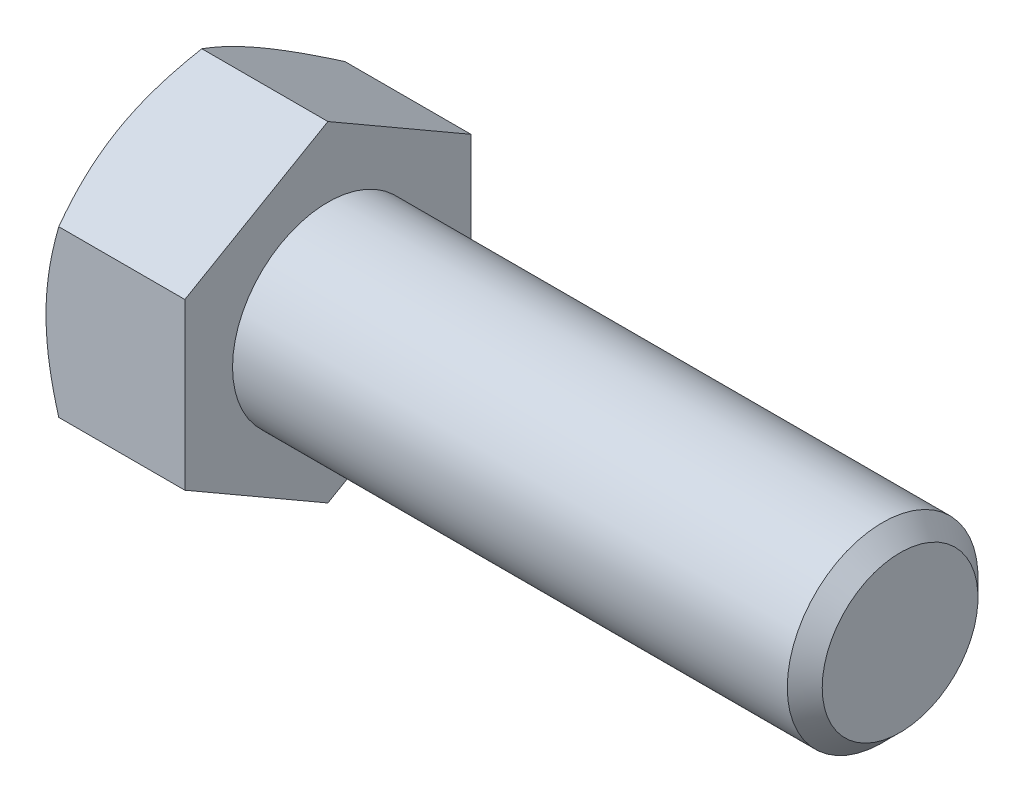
ISO-10303-21;
HEADER;
FILE_DESCRIPTION(('STEP AP214'),'2;1');
FILE_NAME('part.step','',(''),(''),'','','');
FILE_SCHEMA(('AUTOMOTIVE_DESIGN { 1 0 10303 214 1 1 1 1 }'));
ENDSEC;
DATA;
#1=APPLICATION_CONTEXT('core data for automotive mechanical design processes');
#2=APPLICATION_PROTOCOL_DEFINITION('international standard','automotive_design',2000,#1);
#3=PRODUCT_CONTEXT('',#1,'mechanical');
#4=PRODUCT('Part','Part','',(#3));
#5=PRODUCT_RELATED_PRODUCT_CATEGORY('part','',(#4));
#6=PRODUCT_DEFINITION_FORMATION('','',#4);
#7=PRODUCT_DEFINITION_CONTEXT('part definition',#1,'design');
#8=PRODUCT_DEFINITION('design','',#6,#7);
#9=PRODUCT_DEFINITION_SHAPE('','',#8);
#10=(LENGTH_UNIT() NAMED_UNIT(*) SI_UNIT(.MILLI.,.METRE.));
#11=(NAMED_UNIT(*) PLANE_ANGLE_UNIT() SI_UNIT($,.RADIAN.));
#12=(NAMED_UNIT(*) SI_UNIT($,.STERADIAN.) SOLID_ANGLE_UNIT());
#13=UNCERTAINTY_MEASURE_WITH_UNIT(LENGTH_MEASURE(1.E-05),#10,'distance_accuracy_value','');
#14=(GEOMETRIC_REPRESENTATION_CONTEXT(3) GLOBAL_UNCERTAINTY_ASSIGNED_CONTEXT((#13)) GLOBAL_UNIT_ASSIGNED_CONTEXT((#10,
#11,#12)) REPRESENTATION_CONTEXT('',''));
#15=CARTESIAN_POINT('',(0.,0.,0.));
#16=DIRECTION('',(0.,0.,1.));
#17=DIRECTION('',(1.,0.,0.));
#18=AXIS2_PLACEMENT_3D('',#15,#16,#17);
#19=CARTESIAN_POINT('',(9.2456,5.49926131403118,-9.525));
#20=DIRECTION('',(0.,-0.866025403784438,0.500000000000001));
#21=DIRECTION('',(0.,-0.500000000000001,-0.866025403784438));
#22=AXIS2_PLACEMENT_3D('',#19,#20,#21);
#23=PLANE('',#22);
#24=CARTESIAN_POINT('',(0.850805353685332,10.9986380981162,0.0002));
#25=CARTESIAN_POINT('',(0.781023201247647,10.8777523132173,-0.209180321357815));
#26=CARTESIAN_POINT('',(0.714408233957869,10.7564158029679,-0.419341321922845));
#27=CARTESIAN_POINT('',(0.58839146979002,10.5127697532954,-0.841348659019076));
#28=CARTESIAN_POINT('',(0.528992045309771,10.3904599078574,-1.05319552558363));
#29=CARTESIAN_POINT('',(0.362766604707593,10.0215595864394,-1.69214962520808));
#30=CARTESIAN_POINT('',(0.268218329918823,9.77351282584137,-2.12177921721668));
#31=CARTESIAN_POINT('',(0.157351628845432,9.40232220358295,-2.76470023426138));
#32=CARTESIAN_POINT('',(0.125769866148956,9.28028730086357,-2.97607088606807));
#33=CARTESIAN_POINT('',(0.0728092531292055,9.03565248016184,-3.39979082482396));
#34=CARTESIAN_POINT('',(0.0514305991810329,8.91305255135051,-3.61214013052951));
#35=CARTESIAN_POINT('',(0.0194239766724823,8.66764818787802,-4.03719295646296));
#36=CARTESIAN_POINT('',(0.00878323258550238,8.54484417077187,-4.24989575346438));
#37=CARTESIAN_POINT('',(-0.00152146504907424,8.29912270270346,-4.67549782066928));
#38=CARTESIAN_POINT('',(-0.00118575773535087,8.17620525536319,-4.88839708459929));
#39=CARTESIAN_POINT('',(0.0096988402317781,7.94640807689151,-5.28641747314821));
#40=CARTESIAN_POINT('',(0.0189199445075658,7.83951212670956,-5.47156668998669));
#41=CARTESIAN_POINT('',(0.0454848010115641,7.62597023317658,-5.84143209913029));
#42=CARTESIAN_POINT('',(0.0628291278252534,7.51932430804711,-6.02614825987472));
#43=CARTESIAN_POINT('',(0.126636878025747,7.19979976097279,-6.57958100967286));
#44=CARTESIAN_POINT('',(0.184867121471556,6.98748672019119,-6.94731798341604));
#45=CARTESIAN_POINT('',(0.330443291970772,6.56060850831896,-7.68669273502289));
#46=CARTESIAN_POINT('',(0.418406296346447,6.3460978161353,-8.05823615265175));
#47=CARTESIAN_POINT('',(0.618045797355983,5.92027529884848,-8.79578238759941));
#48=CARTESIAN_POINT('',(0.729675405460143,5.70895802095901,-9.16179464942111));
#49=CARTESIAN_POINT('',(0.850805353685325,5.49914584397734,-9.5252));
#50=B_SPLINE_CURVE_WITH_KNOTS('',3,(#24,#25,#26,#27,#28,#29,#30,#31,#32,#33,#34,#35,#36,#37,#38,
#39,#40,#41,#42,#43,#44,#45,#46,#47,#48,#49),.UNSPECIFIED.,.F.,.F.,(4,2,2,2,2,2,2,2,2,2,2,2,4),
(0.,0.754861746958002,1.50997101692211,3.02340406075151,3.76154608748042,4.49970232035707,
5.23697928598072,5.97423347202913,6.61604550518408,7.25790294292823,8.54252993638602,
9.85564695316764,11.1661863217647),.UNSPECIFIED.);
#51=CARTESIAN_POINT('',(0.850738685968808,10.9985226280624,0.));
#52=VERTEX_POINT('',#51);
#53=CARTESIAN_POINT('',(0.,8.24889197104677,-4.76250000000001));
#54=VERTEX_POINT('',#53);
#55=EDGE_CURVE('E46',#52,#54,#50,.T.);
#56=ORIENTED_EDGE('',*,*,#55,.F.);
#57=DIRECTION('',(-1.,0.,0.));
#58=VECTOR('',#57,1.);
#59=CARTESIAN_POINT('',(9.2456,10.9985226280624,0.));
#60=LINE('',#59,#58);
#61=CARTESIAN_POINT('',(9.2456,10.9985226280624,0.));
#62=VERTEX_POINT('',#61);
#63=EDGE_CURVE('E142',#62,#52,#60,.T.);
#64=ORIENTED_EDGE('',*,*,#63,.F.);
#65=DIRECTION('',(0.,0.500000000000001,0.866025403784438));
#66=VECTOR('',#65,1.);
#67=CARTESIAN_POINT('',(9.2456,5.49926131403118,-9.525));
#68=LINE('',#67,#66);
#69=CARTESIAN_POINT('',(9.2456,5.49926131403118,-9.525));
#70=VERTEX_POINT('',#69);
#71=EDGE_CURVE('E227',#70,#62,#68,.T.);
#72=ORIENTED_EDGE('',*,*,#71,.F.);
#73=DIRECTION('',(-1.,0.,0.));
#74=VECTOR('',#73,1.);
#75=CARTESIAN_POINT('',(9.2456,5.49926131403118,-9.525));
#76=LINE('',#75,#74);
#77=CARTESIAN_POINT('',(0.850738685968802,5.49926131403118,-9.525));
#78=VERTEX_POINT('',#77);
#79=EDGE_CURVE('E130',#70,#78,#76,.T.);
#80=ORIENTED_EDGE('',*,*,#79,.T.);
#81=EDGE_CURVE('E124',#54,#78,#50,.T.);
#82=ORIENTED_EDGE('',*,*,#81,.F.);
#83=EDGE_LOOP('',(#56,#64,#72,#80,#82));
#84=FACE_BOUND('',#83,.T.);
#85=ADVANCED_FACE('F30',(#84),#23,.F.);
#86=CARTESIAN_POINT('',(9.2456,10.9985226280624,0.));
#87=DIRECTION('',(0.,-0.866025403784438,-0.500000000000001));
#88=DIRECTION('',(0.,0.500000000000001,-0.866025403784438));
#89=AXIS2_PLACEMENT_3D('',#86,#87,#88);
#90=PLANE('',#89);
#91=CARTESIAN_POINT('',(0.850805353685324,5.49914584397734,9.5252));
#92=CARTESIAN_POINT('',(0.781023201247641,5.62003162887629,9.31581967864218));
#93=CARTESIAN_POINT('',(0.714408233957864,5.74136813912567,9.10565867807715));
#94=CARTESIAN_POINT('',(0.588391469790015,5.98501418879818,8.68365134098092));
#95=CARTESIAN_POINT('',(0.528992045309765,6.1073240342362,8.47180447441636));
#96=CARTESIAN_POINT('',(0.362766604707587,6.47622435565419,7.83285037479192));
#97=CARTESIAN_POINT('',(0.268218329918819,6.72427111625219,7.40322078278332));
#98=CARTESIAN_POINT('',(0.157351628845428,7.09546173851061,6.76029976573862));
#99=CARTESIAN_POINT('',(0.125769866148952,7.21749664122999,6.54892911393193));
#100=CARTESIAN_POINT('',(0.0728092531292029,7.46213146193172,6.12520917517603));
#101=CARTESIAN_POINT('',(0.0514305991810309,7.58473139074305,5.91285986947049));
#102=CARTESIAN_POINT('',(0.0194239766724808,7.83013575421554,5.48780704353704));
#103=CARTESIAN_POINT('',(0.00878323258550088,7.9529397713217,5.27510424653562));
#104=CARTESIAN_POINT('',(-0.00152146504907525,8.1986612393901,4.84950217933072));
#105=CARTESIAN_POINT('',(-0.00118575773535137,8.32157868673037,4.63660291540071));
#106=CARTESIAN_POINT('',(0.009698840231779,8.55137586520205,4.23858252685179));
#107=CARTESIAN_POINT('',(0.0189199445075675,8.658271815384,4.05343331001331));
#108=CARTESIAN_POINT('',(0.0454848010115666,8.87181370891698,3.68356790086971));
#109=CARTESIAN_POINT('',(0.0628291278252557,8.97845963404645,3.49885174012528));
#110=CARTESIAN_POINT('',(0.12663687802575,9.29798418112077,2.94541899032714));
#111=CARTESIAN_POINT('',(0.18486712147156,9.51029722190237,2.57768201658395));
#112=CARTESIAN_POINT('',(0.330443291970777,9.9371754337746,1.83830726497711));
#113=CARTESIAN_POINT('',(0.418406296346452,10.1516861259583,1.46676384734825));
#114=CARTESIAN_POINT('',(0.618045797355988,10.5775086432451,0.729217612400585));
#115=CARTESIAN_POINT('',(0.729675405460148,10.7888259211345,0.363205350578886));
#116=CARTESIAN_POINT('',(0.850805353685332,10.9986380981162,-0.000199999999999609));
#117=B_SPLINE_CURVE_WITH_KNOTS('',3,(#91,#92,#93,#94,#95,#96,#97,#98,#99,#100,#101,#102,#103,
#104,#105,#106,#107,#108,#109,#110,#111,#112,#113,#114,#115,#116),.UNSPECIFIED.,.F.,.F.,(4,2,2,
2,2,2,2,2,2,2,2,2,4),(0.,0.754861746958,1.50997101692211,3.0234040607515,3.76154608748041,
4.49970232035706,5.23697928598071,5.97423347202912,6.61604550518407,7.25790294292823,
8.54252993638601,9.85564695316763,11.1661863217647),.UNSPECIFIED.);
#118=CARTESIAN_POINT('',(0.850738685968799,5.49926131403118,9.525));
#119=VERTEX_POINT('',#118);
#120=CARTESIAN_POINT('',(0.,8.24889197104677,4.76250000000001));
#121=VERTEX_POINT('',#120);
#122=EDGE_CURVE('E53',#119,#121,#117,.T.);
#123=ORIENTED_EDGE('',*,*,#122,.F.);
#124=DIRECTION('',(-1.,0.,0.));
#125=VECTOR('',#124,1.);
#126=CARTESIAN_POINT('',(9.2456,5.49926131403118,9.525));
#127=LINE('',#126,#125);
#128=CARTESIAN_POINT('',(9.2456,5.49926131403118,9.525));
#129=VERTEX_POINT('',#128);
#130=EDGE_CURVE('E140',#129,#119,#127,.T.);
#131=ORIENTED_EDGE('',*,*,#130,.F.);
#132=DIRECTION('',(0.,-0.500000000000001,0.866025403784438));
#133=VECTOR('',#132,1.);
#134=CARTESIAN_POINT('',(9.2456,10.9985226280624,0.));
#135=LINE('',#134,#133);
#136=EDGE_CURVE('E225',#62,#129,#135,.T.);
#137=ORIENTED_EDGE('',*,*,#136,.F.);
#138=ORIENTED_EDGE('',*,*,#63,.T.);
#139=EDGE_CURVE('E157',#121,#52,#117,.T.);
#140=ORIENTED_EDGE('',*,*,#139,.F.);
#141=EDGE_LOOP('',(#123,#131,#137,#138,#140));
#142=FACE_BOUND('',#141,.T.);
#143=ADVANCED_FACE('F163',(#142),#90,.F.);
#144=CARTESIAN_POINT('',(9.2456,5.49926131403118,9.525));
#145=DIRECTION('',(0.,0.,-1.));
#146=DIRECTION('',(-1.,0.,0.));
#147=AXIS2_PLACEMENT_3D('',#144,#145,#146);
#148=PLANE('',#147);
#149=CARTESIAN_POINT('',(4.65297862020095,-14.7810115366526,9.525));
#150=CARTESIAN_POINT('',(4.55200114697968,-14.5729402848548,9.525));
#151=CARTESIAN_POINT('',(4.45152657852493,-14.3646250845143,9.525));
#152=CARTESIAN_POINT('',(4.25169715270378,-13.9474558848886,9.525));
#153=CARTESIAN_POINT('',(4.15234230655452,-13.7386018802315,9.525));
#154=CARTESIAN_POINT('',(3.85610205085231,-13.1110997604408,9.525));
#155=CARTESIAN_POINT('',(3.66107082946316,-12.6915729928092,9.525));
#156=CARTESIAN_POINT('',(3.2760831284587,-11.8474364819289,9.525));
#157=CARTESIAN_POINT('',(3.08615996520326,-11.422811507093,9.525));
#158=CARTESIAN_POINT('',(2.71407238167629,-10.5701875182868,9.525));
#159=CARTESIAN_POINT('',(2.53190759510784,-10.1421886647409,9.525));
#160=CARTESIAN_POINT('',(2.17173180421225,-9.2684082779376,9.525));
#161=CARTESIAN_POINT('',(1.99403865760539,-8.82249500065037,9.525));
#162=CARTESIAN_POINT('',(1.6520780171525,-7.92545654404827,9.525));
#163=CARTESIAN_POINT('',(1.48781202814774,-7.47433078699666,9.525));
#164=CARTESIAN_POINT('',(1.17701101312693,-6.56698486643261,9.525));
#165=CARTESIAN_POINT('',(1.03044020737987,-6.11077709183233,9.525));
#166=CARTESIAN_POINT('',(0.759723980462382,-5.19183461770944,9.525));
#167=CARTESIAN_POINT('',(0.635571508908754,-4.72910201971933,9.525));
#168=CARTESIAN_POINT('',(0.416296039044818,-3.79927533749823,9.525));
#169=CARTESIAN_POINT('',(0.321019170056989,-3.33221854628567,9.525));
#170=CARTESIAN_POINT('',(0.203895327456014,-2.62737339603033,9.525));
#171=CARTESIAN_POINT('',(0.169151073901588,-2.39169815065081,9.525));
#172=CARTESIAN_POINT('',(0.108940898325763,-1.91917305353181,9.525));
#173=CARTESIAN_POINT('',(0.0834740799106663,-1.68232331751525,9.525));
#174=CARTESIAN_POINT('',(0.042646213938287,-1.21086692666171,9.525));
#175=CARTESIAN_POINT('',(0.0271575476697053,-0.976271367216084,9.525));
#176=CARTESIAN_POINT('',(0.00611497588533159,-0.506635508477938,9.525));
#177=CARTESIAN_POINT('',(0.000560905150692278,-0.271595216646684,9.525));
#178=CARTESIAN_POINT('',(-0.000479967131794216,0.198511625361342,9.525));
#179=CARTESIAN_POINT('',(0.0040333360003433,0.433578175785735,9.525));
#180=CARTESIAN_POINT('',(0.0230169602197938,0.903311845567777,9.525));
#181=CARTESIAN_POINT('',(0.0374877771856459,1.1379789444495,9.525));
#182=CARTESIAN_POINT('',(0.0838926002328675,1.70156520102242,9.525));
#183=CARTESIAN_POINT('',(0.120529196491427,2.03010533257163,9.525));
#184=CARTESIAN_POINT('',(0.211324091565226,2.68473880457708,9.525));
#185=CARTESIAN_POINT('',(0.265484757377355,3.01083180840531,9.525));
#186=CARTESIAN_POINT('',(0.451380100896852,3.98506326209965,9.525));
#187=CARTESIAN_POINT('',(0.606495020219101,4.62879899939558,9.525));
#188=CARTESIAN_POINT('',(0.875429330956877,5.59158230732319,9.525));
#189=CARTESIAN_POINT('',(0.972405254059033,5.91562142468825,9.525));
#190=CARTESIAN_POINT('',(1.1764087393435,6.56055109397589,9.525));
#191=CARTESIAN_POINT('',(1.28343637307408,6.88144162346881,9.525));
#192=CARTESIAN_POINT('',(1.50582732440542,7.52017825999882,9.525));
#193=CARTESIAN_POINT('',(1.62118794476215,7.83802531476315,9.525));
#194=CARTESIAN_POINT('',(1.85888923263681,8.47108431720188,9.525));
#195=CARTESIAN_POINT('',(1.98122977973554,8.78629631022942,9.525));
#196=CARTESIAN_POINT('',(2.3006347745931,9.5871627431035,9.525));
#197=CARTESIAN_POINT('',(2.5017818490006,10.0711868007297,9.525));
#198=CARTESIAN_POINT('',(2.91473175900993,11.0346830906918,9.525));
#199=CARTESIAN_POINT('',(3.12653548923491,11.514154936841,9.525));
#200=CARTESIAN_POINT('',(3.55844219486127,12.469507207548,9.525));
#201=CARTESIAN_POINT('',(3.77854763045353,12.9453865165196,9.525));
#202=CARTESIAN_POINT('',(4.22520690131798,13.8940827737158,9.525));
#203=CARTESIAN_POINT('',(4.45176054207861,14.3668998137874,9.525));
#204=CARTESIAN_POINT('',(4.91030379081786,15.3106675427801,9.525));
#205=CARTESIAN_POINT('',(5.14230026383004,15.7816148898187,9.525));
#206=CARTESIAN_POINT('',(5.61043419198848,16.7214473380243,9.525));
#207=CARTESIAN_POINT('',(5.84657167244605,17.1903324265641,9.525));
#208=CARTESIAN_POINT('',(6.32217781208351,18.126306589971,9.525));
#209=CARTESIAN_POINT('',(6.56164589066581,18.5933959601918,9.525));
#210=CARTESIAN_POINT('',(7.04336394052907,19.5261387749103,9.525));
#211=CARTESIAN_POINT('',(7.28561392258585,19.9917922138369,9.525));
#212=CARTESIAN_POINT('',(7.96929589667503,21.298052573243,9.525));
#213=CARTESIAN_POINT('',(8.41334550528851,22.1372892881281,9.525));
#214=CARTESIAN_POINT('',(9.30698696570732,23.8128512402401,9.525));
#215=CARTESIAN_POINT('',(9.75657908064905,24.6491763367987,9.525));
#216=CARTESIAN_POINT('',(10.6586387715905,26.3171534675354,9.525));
#217=CARTESIAN_POINT('',(11.1110942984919,27.1488120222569,9.525));
#218=CARTESIAN_POINT('',(11.7921739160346,28.3949535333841,9.525));
#219=CARTESIAN_POINT('',(12.019592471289,28.8100962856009,9.525));
#220=CARTESIAN_POINT('',(12.4751463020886,29.6399876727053,9.525));
#221=CARTESIAN_POINT('',(12.703281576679,30.0547363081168,9.525));
#222=CARTESIAN_POINT('',(12.9317320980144,30.4693112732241,9.525));
#223=B_SPLINE_CURVE_WITH_KNOTS('',3,(#149,#150,#151,#152,#153,#154,#155,#156,#157,#158,#159,
#160,#161,#162,#163,#164,#165,#166,#167,#168,#169,#170,#171,#172,#173,#174,#175,#176,#177,#178,
#179,#180,#181,#182,#183,#184,#185,#186,#187,#188,#189,#190,#191,#192,#193,#194,#195,#196,#197,
#198,#199,#200,#201,#202,#203,#204,#205,#206,#207,#208,#209,#210,#211,#212,#213,#214,#215,#216,
#217,#218,#219,#220,#221,#222),.UNSPECIFIED.,.F.,.F.,(4,2,2,2,2,2,2,2,2,2,2,2,2,2,2,2,2,2,2,2,2,
2,2,2,2,2,2,2,2,2,2,2,2,2,2,2,4),(0.,0.693836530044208,1.38768000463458,2.77557197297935,
4.17100213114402,5.56636633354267,7.00624082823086,8.44627647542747,9.88334978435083,
11.3199703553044,12.748795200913,13.463308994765,14.1777537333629,14.882869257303,
15.5879730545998,16.2930841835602,16.9982304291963,17.9894005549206,18.9807046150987,
20.9643780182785,21.979010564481,22.9936503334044,24.0079631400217,25.022258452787,
26.5945433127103,28.1669603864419,29.7398471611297,31.3126865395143,32.8876294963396,
34.4625820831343,36.0372634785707,37.6119509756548,40.460336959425,43.3088586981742,
46.1491565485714,47.569213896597,48.9892693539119),.UNSPECIFIED.);
#224=CARTESIAN_POINT('',(0.850738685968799,-5.49926131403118,9.525));
#225=VERTEX_POINT('',#224);
#226=CARTESIAN_POINT('',(0.,0.,9.525));
#227=VERTEX_POINT('',#226);
#228=EDGE_CURVE('E237',#225,#227,#223,.T.);
#229=ORIENTED_EDGE('',*,*,#228,.F.);
#230=DIRECTION('',(-1.,0.,0.));
#231=VECTOR('',#230,1.);
#232=CARTESIAN_POINT('',(9.2456,-5.49926131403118,9.525));
#233=LINE('',#232,#231);
#234=CARTESIAN_POINT('',(9.2456,-5.49926131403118,9.525));
#235=VERTEX_POINT('',#234);
#236=EDGE_CURVE('E132',#235,#225,#233,.T.);
#237=ORIENTED_EDGE('',*,*,#236,.F.);
#238=DIRECTION('',(0.,-1.,0.));
#239=VECTOR('',#238,1.);
#240=CARTESIAN_POINT('',(9.2456,5.49926131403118,9.525));
#241=LINE('',#240,#239);
#242=EDGE_CURVE('E221',#129,#235,#241,.T.);
#243=ORIENTED_EDGE('',*,*,#242,.F.);
#244=ORIENTED_EDGE('',*,*,#130,.T.);
#245=EDGE_CURVE('E179',#227,#119,#223,.T.);
#246=ORIENTED_EDGE('',*,*,#245,.F.);
#247=EDGE_LOOP('',(#229,#237,#243,#244,#246));
#248=FACE_BOUND('',#247,.T.);
#249=ADVANCED_FACE('F243',(#248),#148,.F.);
#250=CARTESIAN_POINT('',(9.2456,-10.9985226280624,0.));
#251=DIRECTION('',(0.,0.866025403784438,-0.500000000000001));
#252=DIRECTION('',(0.,0.500000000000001,0.866025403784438));
#253=AXIS2_PLACEMENT_3D('',#250,#251,#252);
#254=PLANE('',#253);
#255=CARTESIAN_POINT('',(0.850805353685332,-10.9986380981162,-0.000199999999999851));
#256=CARTESIAN_POINT('',(0.781023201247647,-10.8777523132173,0.209180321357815));
#257=CARTESIAN_POINT('',(0.714408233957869,-10.7564158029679,0.419341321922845));
#258=CARTESIAN_POINT('',(0.58839146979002,-10.5127697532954,0.841348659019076));
#259=CARTESIAN_POINT('',(0.528992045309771,-10.3904599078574,1.05319552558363));
#260=CARTESIAN_POINT('',(0.362766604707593,-10.0215595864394,1.69214962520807));
#261=CARTESIAN_POINT('',(0.268218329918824,-9.77351282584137,2.12177921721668));
#262=CARTESIAN_POINT('',(0.157351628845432,-9.40232220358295,2.76470023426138));
#263=CARTESIAN_POINT('',(0.125769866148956,-9.28028730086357,2.97607088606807));
#264=CARTESIAN_POINT('',(0.0728092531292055,-9.03565248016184,3.39979082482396));
#265=CARTESIAN_POINT('',(0.0514305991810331,-8.91305255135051,3.61214013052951));
#266=CARTESIAN_POINT('',(0.0194239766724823,-8.66764818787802,4.03719295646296));
#267=CARTESIAN_POINT('',(0.00878323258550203,-8.54484417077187,4.24989575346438));
#268=CARTESIAN_POINT('',(-0.00152146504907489,-8.29912270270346,4.67549782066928));
#269=CARTESIAN_POINT('',(-0.00118575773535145,-8.17620525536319,4.88839708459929));
#270=CARTESIAN_POINT('',(0.00969884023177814,-7.94640807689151,5.28641747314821));
#271=CARTESIAN_POINT('',(0.0189199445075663,-7.83951212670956,5.47156668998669));
#272=CARTESIAN_POINT('',(0.0454848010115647,-7.62597023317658,5.84143209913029));
#273=CARTESIAN_POINT('',(0.0628291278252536,-7.51932430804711,6.02614825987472));
#274=CARTESIAN_POINT('',(0.126636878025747,-7.19979976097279,6.57958100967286));
#275=CARTESIAN_POINT('',(0.184867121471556,-6.98748672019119,6.94731798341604));
#276=CARTESIAN_POINT('',(0.330443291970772,-6.56060850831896,7.68669273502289));
#277=CARTESIAN_POINT('',(0.418406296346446,-6.3460978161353,8.05823615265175));
#278=CARTESIAN_POINT('',(0.618045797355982,-5.92027529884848,8.79578238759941));
#279=CARTESIAN_POINT('',(0.729675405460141,-5.70895802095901,9.16179464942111));
#280=CARTESIAN_POINT('',(0.850805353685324,-5.49914584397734,9.5252));
#281=B_SPLINE_CURVE_WITH_KNOTS('',3,(#255,#256,#257,#258,#259,#260,#261,#262,#263,#264,#265,
#266,#267,#268,#269,#270,#271,#272,#273,#274,#275,#276,#277,#278,#279,#280),.UNSPECIFIED.,.F.,
.F.,(4,2,2,2,2,2,2,2,2,2,2,2,4),(0.,0.754861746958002,1.50997101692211,3.02340406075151,
3.76154608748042,4.49970232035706,5.23697928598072,5.97423347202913,6.61604550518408,
7.25790294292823,8.54252993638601,9.85564695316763,11.1661863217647),.UNSPECIFIED.);
#282=CARTESIAN_POINT('',(0.850738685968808,-10.9985226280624,0.));
#283=VERTEX_POINT('',#282);
#284=CARTESIAN_POINT('',(0.,-8.24889197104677,4.76250000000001));
#285=VERTEX_POINT('',#284);
#286=EDGE_CURVE('E165',#283,#285,#281,.T.);
#287=ORIENTED_EDGE('',*,*,#286,.F.);
#288=DIRECTION('',(-1.,0.,0.));
#289=VECTOR('',#288,1.);
#290=CARTESIAN_POINT('',(9.2456,-10.9985226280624,0.));
#291=LINE('',#290,#289);
#292=CARTESIAN_POINT('',(9.2456,-10.9985226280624,0.));
#293=VERTEX_POINT('',#292);
#294=EDGE_CURVE('E129',#293,#283,#291,.T.);
#295=ORIENTED_EDGE('',*,*,#294,.F.);
#296=DIRECTION('',(0.,-0.500000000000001,-0.866025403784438));
#297=VECTOR('',#296,1.);
#298=CARTESIAN_POINT('',(9.2456,-10.9985226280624,0.));
#299=LINE('',#298,#297);
#300=EDGE_CURVE('E219',#235,#293,#299,.T.);
#301=ORIENTED_EDGE('',*,*,#300,.F.);
#302=ORIENTED_EDGE('',*,*,#236,.T.);
#303=EDGE_CURVE('E167',#285,#225,#281,.T.);
#304=ORIENTED_EDGE('',*,*,#303,.F.);
#305=EDGE_LOOP('',(#287,#295,#301,#302,#304));
#306=FACE_BOUND('',#305,.T.);
#307=ADVANCED_FACE('F215',(#306),#254,.F.);
#308=CARTESIAN_POINT('',(9.2456,-5.4992613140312,-9.525));
#309=DIRECTION('',(0.,0.866025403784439,0.5));
#310=DIRECTION('',(0.,-0.5,0.866025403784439));
#311=AXIS2_PLACEMENT_3D('',#308,#309,#310);
#312=PLANE('',#311);
#313=CARTESIAN_POINT('',(0.850805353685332,-5.49914584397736,-9.52520000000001));
#314=CARTESIAN_POINT('',(0.781023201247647,-5.6200316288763,-9.31581967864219));
#315=CARTESIAN_POINT('',(0.71440823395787,-5.74136813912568,-9.10565867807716));
#316=CARTESIAN_POINT('',(0.588391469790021,-5.98501418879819,-8.68365134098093));
#317=CARTESIAN_POINT('',(0.528992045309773,-6.10732403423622,-8.47180447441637));
#318=CARTESIAN_POINT('',(0.362766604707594,-6.4762243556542,-7.83285037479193));
#319=CARTESIAN_POINT('',(0.268218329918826,-6.7242711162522,-7.40322078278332));
#320=CARTESIAN_POINT('',(0.157351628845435,-7.09546173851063,-6.76029976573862));
#321=CARTESIAN_POINT('',(0.125769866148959,-7.21749664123,-6.54892911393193));
#322=CARTESIAN_POINT('',(0.0728092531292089,-7.46213146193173,-6.12520917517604));
#323=CARTESIAN_POINT('',(0.0514305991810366,-7.58473139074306,-5.91285986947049));
#324=CARTESIAN_POINT('',(0.019423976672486,-7.83013575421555,-5.48780704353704));
#325=CARTESIAN_POINT('',(0.00878323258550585,-7.9529397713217,-5.27510424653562));
#326=CARTESIAN_POINT('',(-0.0015214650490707,-8.19866123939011,-4.84950217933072));
#327=CARTESIAN_POINT('',(-0.00118575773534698,-8.32157868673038,-4.63660291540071));
#328=CARTESIAN_POINT('',(0.00969884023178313,-8.55137586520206,-4.23858252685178));
#329=CARTESIAN_POINT('',(0.0189199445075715,-8.658271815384,-4.0534333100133));
#330=CARTESIAN_POINT('',(0.0454848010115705,-8.87181370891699,-3.68356790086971));
#331=CARTESIAN_POINT('',(0.0628291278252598,-8.97845963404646,-3.49885174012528));
#332=CARTESIAN_POINT('',(0.126636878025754,-9.29798418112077,-2.94541899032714));
#333=CARTESIAN_POINT('',(0.184867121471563,-9.51029722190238,-2.57768201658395));
#334=CARTESIAN_POINT('',(0.330443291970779,-9.9371754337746,-1.83830726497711));
#335=CARTESIAN_POINT('',(0.418406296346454,-10.1516861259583,-1.46676384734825));
#336=CARTESIAN_POINT('',(0.61804579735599,-10.5775086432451,-0.729217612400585));
#337=CARTESIAN_POINT('',(0.729675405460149,-10.7888259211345,-0.363205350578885));
#338=CARTESIAN_POINT('',(0.850805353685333,-10.9986380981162,0.000200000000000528));
#339=B_SPLINE_CURVE_WITH_KNOTS('',3,(#313,#314,#315,#316,#317,#318,#319,#320,#321,#322,#323,
#324,#325,#326,#327,#328,#329,#330,#331,#332,#333,#334,#335,#336,#337,#338),.UNSPECIFIED.,.F.,
.F.,(4,2,2,2,2,2,2,2,2,2,2,2,4),(0.,0.754861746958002,1.50997101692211,3.02340406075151,
3.76154608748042,4.49970232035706,5.23697928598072,5.97423347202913,6.61604550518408,
7.25790294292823,8.54252993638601,9.85564695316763,11.1661863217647),.UNSPECIFIED.);
#340=CARTESIAN_POINT('',(0.850738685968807,-5.4992613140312,-9.525));
#341=VERTEX_POINT('',#340);
#342=CARTESIAN_POINT('',(0.,-8.24889197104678,-4.7625));
#343=VERTEX_POINT('',#342);
#344=EDGE_CURVE('E106',#341,#343,#339,.T.);
#345=ORIENTED_EDGE('',*,*,#344,.F.);
#346=DIRECTION('',(-1.,0.,0.));
#347=VECTOR('',#346,1.);
#348=CARTESIAN_POINT('',(9.2456,-5.4992613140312,-9.525));
#349=LINE('',#348,#347);
#350=CARTESIAN_POINT('',(9.2456,-5.4992613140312,-9.525));
#351=VERTEX_POINT('',#350);
#352=EDGE_CURVE('E120',#351,#341,#349,.T.);
#353=ORIENTED_EDGE('',*,*,#352,.F.);
#354=DIRECTION('',(0.,0.5,-0.866025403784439));
#355=VECTOR('',#354,1.);
#356=CARTESIAN_POINT('',(9.2456,-5.4992613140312,-9.525));
#357=LINE('',#356,#355);
#358=EDGE_CURVE('E217',#293,#351,#357,.T.);
#359=ORIENTED_EDGE('',*,*,#358,.F.);
#360=ORIENTED_EDGE('',*,*,#294,.T.);
#361=EDGE_CURVE('E123',#343,#283,#339,.T.);
#362=ORIENTED_EDGE('',*,*,#361,.F.);
#363=EDGE_LOOP('',(#345,#353,#359,#360,#362));
#364=FACE_BOUND('',#363,.T.);
#365=ADVANCED_FACE('F118',(#364),#312,.F.);
#366=CARTESIAN_POINT('',(9.2456,5.49926131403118,-9.525));
#367=DIRECTION('',(0.,0.,1.));
#368=DIRECTION('',(0.,-1.,0.));
#369=AXIS2_PLACEMENT_3D('',#366,#367,#368);
#370=PLANE('',#369);
#371=CARTESIAN_POINT('',(4.65297862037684,-14.781011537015,-9.52500000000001));
#372=CARTESIAN_POINT('',(4.55200114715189,-14.5729402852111,-9.52500000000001));
#373=CARTESIAN_POINT('',(4.45152657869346,-14.3646250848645,-9.52500000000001));
#374=CARTESIAN_POINT('',(4.25169715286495,-13.9474558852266,-9.52500000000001));
#375=CARTESIAN_POINT('',(4.15234230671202,-13.7386018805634,-9.52500000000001));
#376=CARTESIAN_POINT('',(3.85610205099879,-13.1110997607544,-9.52500000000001));
#377=CARTESIAN_POINT('',(3.66107082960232,-12.6915729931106,-9.52500000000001));
#378=CARTESIAN_POINT('',(3.27608312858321,-11.8474364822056,-9.52500000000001));
#379=CARTESIAN_POINT('',(3.08615996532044,-11.4228115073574,-9.525));
#380=CARTESIAN_POINT('',(2.71407238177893,-10.5701875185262,-9.525));
#381=CARTESIAN_POINT('',(2.53190759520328,-10.1421886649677,-9.525));
#382=CARTESIAN_POINT('',(2.17173180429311,-9.26840827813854,-9.525));
#383=CARTESIAN_POINT('',(1.99403865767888,-8.82249500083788,-9.525));
#384=CARTESIAN_POINT('',(1.65207801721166,-7.92545654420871,-9.525));
#385=CARTESIAN_POINT('',(1.48781202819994,-7.47433078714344,-9.525));
#386=CARTESIAN_POINT('',(1.17701101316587,-6.56698486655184,-9.525));
#387=CARTESIAN_POINT('',(1.03044020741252,-6.11077709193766,-9.525));
#388=CARTESIAN_POINT('',(0.759723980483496,-5.19183461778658,-9.525));
#389=CARTESIAN_POINT('',(0.635571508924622,-4.72910201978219,-9.525));
#390=CARTESIAN_POINT('',(0.41629603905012,-3.79927533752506,-9.525));
#391=CARTESIAN_POINT('',(0.321019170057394,-3.33221854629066,-9.525));
#392=CARTESIAN_POINT('',(0.203895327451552,-2.62737339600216,-9.525));
#393=CARTESIAN_POINT('',(0.169151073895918,-2.39169815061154,-9.525));
#394=CARTESIAN_POINT('',(0.108940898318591,-1.91917305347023,-9.525));
#395=CARTESIAN_POINT('',(0.0834740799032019,-1.68232331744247,-9.525));
#396=CARTESIAN_POINT('',(0.0426462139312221,-1.21086692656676,-9.525));
#397=CARTESIAN_POINT('',(0.0271575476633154,-0.976271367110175,-9.525));
#398=CARTESIAN_POINT('',(0.00611497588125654,-0.506635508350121,-9.525));
#399=CARTESIAN_POINT('',(0.000560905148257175,-0.271595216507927,-9.525));
#400=CARTESIAN_POINT('',(-0.000479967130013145,0.198511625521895,-9.525));
#401=CARTESIAN_POINT('',(0.00403333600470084,0.433578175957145,-9.525));
#402=CARTESIAN_POINT('',(0.0230169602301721,0.903311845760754,-9.525));
#403=CARTESIAN_POINT('',(0.0374877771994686,1.13797894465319,-9.525));
#404=CARTESIAN_POINT('',(0.0838926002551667,1.70156520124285,-9.525));
#405=CARTESIAN_POINT('',(0.120529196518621,2.03010533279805,-9.525));
#406=CARTESIAN_POINT('',(0.211324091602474,2.6847388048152,-9.525));
#407=CARTESIAN_POINT('',(0.265484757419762,3.01083180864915,-9.525));
#408=CARTESIAN_POINT('',(0.45138010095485,3.98506326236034,-9.525));
#409=CARTESIAN_POINT('',(0.606495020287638,4.62879899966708,-9.525));
#410=CARTESIAN_POINT('',(0.875429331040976,5.59158230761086,-9.525));
#411=CARTESIAN_POINT('',(0.972405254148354,5.91562142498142,-9.525));
#412=CARTESIAN_POINT('',(1.17640873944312,6.56055109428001,-9.525));
#413=CARTESIAN_POINT('',(1.28343637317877,6.88144162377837,-9.525));
#414=CARTESIAN_POINT('',(1.50582732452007,7.52017826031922,-9.525));
#415=CARTESIAN_POINT('',(1.62118794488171,7.83802531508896,-9.525));
#416=CARTESIAN_POINT('',(1.85888923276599,8.47108431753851,-9.525));
#417=CARTESIAN_POINT('',(1.98122977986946,8.78629631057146,-9.525));
#418=CARTESIAN_POINT('',(2.30063477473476,9.58716274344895,-9.525));
#419=CARTESIAN_POINT('',(2.50178184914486,10.0711868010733,-9.525));
#420=CARTESIAN_POINT('',(2.91473175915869,11.0346830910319,-9.525));
#421=CARTESIAN_POINT('',(3.12653548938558,11.5141549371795,-9.525));
#422=CARTESIAN_POINT('',(3.55844219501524,12.4695072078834,-9.525));
#423=CARTESIAN_POINT('',(3.77854763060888,12.9453865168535,-9.525));
#424=CARTESIAN_POINT('',(4.22520690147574,13.8940827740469,-9.525));
#425=CARTESIAN_POINT('',(4.45176054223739,14.3668998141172,-9.525));
#426=CARTESIAN_POINT('',(4.91030379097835,15.3106675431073,-9.525));
#427=CARTESIAN_POINT('',(5.14230026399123,15.7816148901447,-9.525));
#428=CARTESIAN_POINT('',(5.61043419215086,16.7214473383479,-9.525));
#429=CARTESIAN_POINT('',(5.84657167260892,17.1903324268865,-9.525));
#430=CARTESIAN_POINT('',(6.32217781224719,18.1263065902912,-9.525));
#431=CARTESIAN_POINT('',(6.56164589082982,18.593395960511,-9.525));
#432=CARTESIAN_POINT('',(7.04336394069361,19.5261387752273,-9.525));
#433=CARTESIAN_POINT('',(7.28561392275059,19.9917922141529,-9.525));
#434=CARTESIAN_POINT('',(7.96929589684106,21.2980525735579,-9.525));
#435=CARTESIAN_POINT('',(8.41334550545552,22.137289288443,-9.525));
#436=CARTESIAN_POINT('',(9.30698696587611,23.8128512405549,-9.525));
#437=CARTESIAN_POINT('',(9.75657908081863,24.6491763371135,-9.525));
#438=CARTESIAN_POINT('',(10.6586387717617,26.3171534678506,-9.525));
#439=CARTESIAN_POINT('',(11.1110942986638,27.1488120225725,-9.525));
#440=CARTESIAN_POINT('',(11.7921739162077,28.3949535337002,-9.525));
#441=CARTESIAN_POINT('',(12.0195924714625,28.8100962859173,-9.525));
#442=CARTESIAN_POINT('',(12.4751463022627,29.6399876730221,-9.525));
#443=CARTESIAN_POINT('',(12.7032815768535,30.0547363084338,-9.525));
#444=CARTESIAN_POINT('',(12.9317320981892,30.4693112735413,-9.525));
#445=B_SPLINE_CURVE_WITH_KNOTS('',3,(#371,#372,#373,#374,#375,#376,#377,#378,#379,#380,#381,
#382,#383,#384,#385,#386,#387,#388,#389,#390,#391,#392,#393,#394,#395,#396,#397,#398,#399,#400,
#401,#402,#403,#404,#405,#406,#407,#408,#409,#410,#411,#412,#413,#414,#415,#416,#417,#418,#419,
#420,#421,#422,#423,#424,#425,#426,#427,#428,#429,#430,#431,#432,#433,#434,#435,#436,#437,#438,
#439,#440,#441,#442,#443,#444),.UNSPECIFIED.,.F.,.F.,(4,2,2,2,2,2,2,2,2,2,2,2,2,2,2,2,2,2,2,2,2,
2,2,2,2,2,2,2,2,2,2,2,2,2,2,2,4),(0.,0.693836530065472,1.38768000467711,2.77557197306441,
4.17100213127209,5.56636633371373,7.00624082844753,8.44627647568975,9.88334978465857,
11.3199703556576,12.7487952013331,13.4633089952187,14.17775373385,14.8828692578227,
15.5879730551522,16.2930841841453,16.9982304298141,17.9894005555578,18.9807046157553,
20.9643780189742,21.979010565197,22.9936503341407,24.0079631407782,25.0222584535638,
26.5945433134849,28.1669603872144,29.7398471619,31.3126865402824,32.8876294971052,
34.4625820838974,36.0372634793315,37.6119509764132,40.4603369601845,43.3088586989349,
46.1491565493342,47.5692138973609,48.9892693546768),.UNSPECIFIED.);
#446=CARTESIAN_POINT('',(0.,0.,-9.525));
#447=VERTEX_POINT('',#446);
#448=EDGE_CURVE('E112',#78,#447,#445,.F.);
#449=ORIENTED_EDGE('',*,*,#448,.F.);
#450=ORIENTED_EDGE('',*,*,#79,.F.);
#451=DIRECTION('',(0.,1.,0.));
#452=VECTOR('',#451,1.);
#453=CARTESIAN_POINT('',(9.2456,5.49926131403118,-9.525));
#454=LINE('',#453,#452);
#455=EDGE_CURVE('E128',#351,#70,#454,.T.);
#456=ORIENTED_EDGE('',*,*,#455,.F.);
#457=ORIENTED_EDGE('',*,*,#352,.T.);
#458=EDGE_CURVE('E103',#447,#341,#445,.F.);
#459=ORIENTED_EDGE('',*,*,#458,.F.);
#460=EDGE_LOOP('',(#449,#450,#456,#457,#459));
#461=FACE_BOUND('',#460,.T.);
#462=ADVANCED_FACE('F126',(#461),#370,.F.);
#463=CARTESIAN_POINT('',(9.2456,10.9985226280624,0.));
#464=DIRECTION('',(1.,0.,0.));
#465=DIRECTION('',(0.,0.,-1.));
#466=AXIS2_PLACEMENT_3D('',#463,#464,#465);
#467=PLANE('',#466);
#468=ORIENTED_EDGE('',*,*,#71,.T.);
#469=ORIENTED_EDGE('',*,*,#136,.T.);
#470=ORIENTED_EDGE('',*,*,#242,.T.);
#471=ORIENTED_EDGE('',*,*,#300,.T.);
#472=ORIENTED_EDGE('',*,*,#358,.T.);
#473=ORIENTED_EDGE('',*,*,#455,.T.);
#474=EDGE_LOOP('',(#468,#469,#470,#471,#472,#473));
#475=FACE_BOUND('',#474,.T.);
#476=CARTESIAN_POINT('',(9.2456,0.,0.));
#477=DIRECTION('',(1.,0.,0.));
#478=DIRECTION('',(0.,0.,-1.));
#479=AXIS2_PLACEMENT_3D('',#476,#477,#478);
#480=CIRCLE('',#479,6.35);
#481=CARTESIAN_POINT('',(9.2456,0.,-6.35));
#482=VERTEX_POINT('',#481);
#483=EDGE_CURVE('E230',#482,#482,#480,.F.);
#484=ORIENTED_EDGE('',*,*,#483,.T.);
#485=EDGE_LOOP('',(#484));
#486=FACE_BOUND('',#485,.T.);
#487=ADVANCED_FACE('F245',(#475,#486),#467,.T.);
#488=CARTESIAN_POINT('',(0.,0.,0.));
#489=DIRECTION('',(-1.,0.,0.));
#490=DIRECTION('',(0.,0.,1.));
#491=AXIS2_PLACEMENT_3D('',#488,#489,#490);
#492=CYLINDRICAL_SURFACE('',#491,6.35);
#493=ORIENTED_EDGE('',*,*,#483,.F.);
#494=EDGE_LOOP('',(#493));
#495=FACE_BOUND('',#494,.T.);
#496=CARTESIAN_POINT('',(46.18228,0.,0.));
#497=DIRECTION('',(-1.,0.,0.));
#498=DIRECTION('',(0.,0.,1.));
#499=AXIS2_PLACEMENT_3D('',#496,#497,#498);
#500=CIRCLE('',#499,6.35);
#501=CARTESIAN_POINT('',(46.18228,0.,6.35));
#502=VERTEX_POINT('',#501);
#503=EDGE_CURVE('E233',#502,#502,#500,.T.);
#504=ORIENTED_EDGE('',*,*,#503,.T.);
#505=EDGE_LOOP('',(#504));
#506=FACE_BOUND('',#505,.T.);
#507=ADVANCED_FACE('F277',(#495,#506),#492,.T.);
#508=CARTESIAN_POINT('',(47.3456,0.,0.));
#509=DIRECTION('',(-1.,0.,0.));
#510=DIRECTION('',(0.,0.,1.));
#511=AXIS2_PLACEMENT_3D('',#508,#509,#510);
#512=CONICAL_SURFACE('',#511,5.18668,0.785398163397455);
#513=ORIENTED_EDGE('',*,*,#503,.F.);
#514=EDGE_LOOP('',(#513));
#515=FACE_BOUND('',#514,.T.);
#516=CARTESIAN_POINT('',(47.3456,0.,0.));
#517=DIRECTION('',(-1.,0.,0.));
#518=DIRECTION('',(0.,0.,1.));
#519=AXIS2_PLACEMENT_3D('',#516,#517,#518);
#520=CIRCLE('',#519,5.18668);
#521=CARTESIAN_POINT('',(47.3456,0.,5.18668));
#522=VERTEX_POINT('',#521);
#523=EDGE_CURVE('E235',#522,#522,#520,.T.);
#524=ORIENTED_EDGE('',*,*,#523,.T.);
#525=EDGE_LOOP('',(#524));
#526=FACE_BOUND('',#525,.T.);
#527=ADVANCED_FACE('F279',(#515,#526),#512,.T.);
#528=CARTESIAN_POINT('',(47.3456,0.,0.));
#529=DIRECTION('',(-1.,0.,0.));
#530=DIRECTION('',(0.,0.,1.));
#531=AXIS2_PLACEMENT_3D('',#528,#529,#530);
#532=PLANE('',#531);
#533=ORIENTED_EDGE('',*,*,#523,.F.);
#534=EDGE_LOOP('',(#533));
#535=FACE_BOUND('',#534,.T.);
#536=ADVANCED_FACE('F192',(#535),#532,.F.);
#537=CARTESIAN_POINT('',(0.,0.,0.));
#538=DIRECTION('',(1.,0.,0.));
#539=DIRECTION('',(0.,0.,-1.));
#540=AXIS2_PLACEMENT_3D('',#537,#538,#539);
#541=CONICAL_SURFACE('',#540,9.525,1.0471975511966);
#542=ORIENTED_EDGE('',*,*,#344,.T.);
#543=CARTESIAN_POINT('',(0.,0.,0.));
#544=DIRECTION('',(1.,0.,0.));
#545=DIRECTION('',(0.,0.,-1.));
#546=AXIS2_PLACEMENT_3D('',#543,#544,#545);
#547=CIRCLE('',#546,9.525);
#548=EDGE_CURVE('E34',#343,#447,#547,.T.);
#549=ORIENTED_EDGE('',*,*,#548,.T.);
#550=ORIENTED_EDGE('',*,*,#458,.T.);
#551=EDGE_LOOP('',(#542,#549,#550));
#552=FACE_BOUND('',#551,.T.);
#553=ADVANCED_FACE('F105',(#552),#541,.T.);
#554=ORIENTED_EDGE('',*,*,#286,.T.);
#555=EDGE_CURVE('E147',#285,#343,#547,.T.);
#556=ORIENTED_EDGE('',*,*,#555,.T.);
#557=ORIENTED_EDGE('',*,*,#361,.T.);
#558=EDGE_LOOP('',(#554,#556,#557));
#559=FACE_BOUND('',#558,.T.);
#560=ADVANCED_FACE('F191',(#559),#541,.T.);
#561=ORIENTED_EDGE('',*,*,#228,.T.);
#562=EDGE_CURVE('E148',#227,#285,#547,.T.);
#563=ORIENTED_EDGE('',*,*,#562,.T.);
#564=ORIENTED_EDGE('',*,*,#303,.T.);
#565=EDGE_LOOP('',(#561,#563,#564));
#566=FACE_BOUND('',#565,.T.);
#567=ADVANCED_FACE('F186',(#566),#541,.T.);
#568=ORIENTED_EDGE('',*,*,#245,.T.);
#569=ORIENTED_EDGE('',*,*,#122,.T.);
#570=CARTESIAN_POINT('',(0.,0.,0.));
#571=DIRECTION('',(-1.,0.,0.));
#572=DIRECTION('',(0.,0.,1.));
#573=AXIS2_PLACEMENT_3D('',#570,#571,#572);
#574=CIRCLE('',#573,9.525);
#575=EDGE_CURVE('E113',#227,#121,#574,.T.);
#576=ORIENTED_EDGE('',*,*,#575,.F.);
#577=EDGE_LOOP('',(#568,#569,#576));
#578=FACE_BOUND('',#577,.T.);
#579=ADVANCED_FACE('F190',(#578),#541,.T.);
#580=ORIENTED_EDGE('',*,*,#139,.T.);
#581=ORIENTED_EDGE('',*,*,#55,.T.);
#582=EDGE_CURVE('E39',#54,#121,#547,.T.);
#583=ORIENTED_EDGE('',*,*,#582,.T.);
#584=EDGE_LOOP('',(#580,#581,#583));
#585=FACE_BOUND('',#584,.T.);
#586=ADVANCED_FACE('F156',(#585),#541,.T.);
#587=ORIENTED_EDGE('',*,*,#81,.T.);
#588=ORIENTED_EDGE('',*,*,#448,.T.);
#589=EDGE_CURVE('E11',#447,#54,#547,.T.);
#590=ORIENTED_EDGE('',*,*,#589,.T.);
#591=EDGE_LOOP('',(#587,#588,#590));
#592=FACE_BOUND('',#591,.T.);
#593=ADVANCED_FACE('F249',(#592),#541,.T.);
#594=CARTESIAN_POINT('',(0.,10.9985226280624,0.));
#595=DIRECTION('',(1.,0.,0.));
#596=DIRECTION('',(0.,0.,-1.));
#597=AXIS2_PLACEMENT_3D('',#594,#595,#596);
#598=PLANE('',#597);
#599=ORIENTED_EDGE('',*,*,#589,.F.);
#600=ORIENTED_EDGE('',*,*,#548,.F.);
#601=ORIENTED_EDGE('',*,*,#555,.F.);
#602=ORIENTED_EDGE('',*,*,#562,.F.);
#603=ORIENTED_EDGE('',*,*,#575,.T.);
#604=ORIENTED_EDGE('',*,*,#582,.F.);
#605=EDGE_LOOP('',(#599,#600,#601,#602,#603,#604));
#606=FACE_BOUND('',#605,.T.);
#607=ADVANCED_FACE('F160',(#606),#598,.F.);
#608=CLOSED_SHELL('',(#85,#143,#249,#307,#365,#462,#487,#507,#527,#536,#553,#560,#567,#579,#586,
#593,#607));
#609=MANIFOLD_SOLID_BREP('B2',#608);
#610=ADVANCED_BREP_SHAPE_REPRESENTATION('',(#18,#609),#14);
#611=SHAPE_DEFINITION_REPRESENTATION(#9,#610);
ENDSEC;
END-ISO-10303-21;
